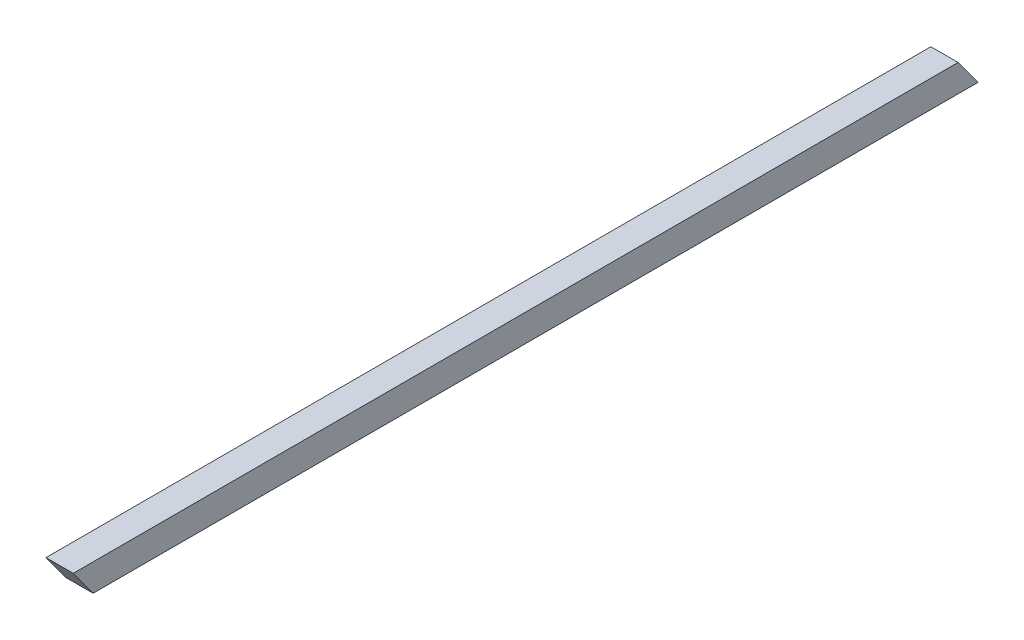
ISO-10303-21;
HEADER;
FILE_DESCRIPTION(('STEP AP214'),'2;1');
FILE_NAME('part.step','',(''),(''),'','','');
FILE_SCHEMA(('AUTOMOTIVE_DESIGN { 1 0 10303 214 1 1 1 1 }'));
ENDSEC;
DATA;
#1=APPLICATION_CONTEXT('core data for automotive mechanical design processes');
#2=APPLICATION_PROTOCOL_DEFINITION('international standard','automotive_design',2000,#1);
#3=PRODUCT_CONTEXT('',#1,'mechanical');
#4=PRODUCT('Part','Part','',(#3));
#5=PRODUCT_RELATED_PRODUCT_CATEGORY('part','',(#4));
#6=PRODUCT_DEFINITION_FORMATION('','',#4);
#7=PRODUCT_DEFINITION_CONTEXT('part definition',#1,'design');
#8=PRODUCT_DEFINITION('design','',#6,#7);
#9=PRODUCT_DEFINITION_SHAPE('','',#8);
#10=(LENGTH_UNIT() NAMED_UNIT(*) SI_UNIT(.MILLI.,.METRE.));
#11=(NAMED_UNIT(*) PLANE_ANGLE_UNIT() SI_UNIT($,.RADIAN.));
#12=(NAMED_UNIT(*) SI_UNIT($,.STERADIAN.) SOLID_ANGLE_UNIT());
#13=UNCERTAINTY_MEASURE_WITH_UNIT(LENGTH_MEASURE(1.E-05),#10,'distance_accuracy_value','');
#14=(GEOMETRIC_REPRESENTATION_CONTEXT(3) GLOBAL_UNCERTAINTY_ASSIGNED_CONTEXT((#13)) GLOBAL_UNIT_ASSIGNED_CONTEXT((#10,
#11,#12)) REPRESENTATION_CONTEXT('',''));
#15=CARTESIAN_POINT('',(0.,0.,0.));
#16=DIRECTION('',(0.,0.,1.));
#17=DIRECTION('',(1.,0.,0.));
#18=AXIS2_PLACEMENT_3D('',#15,#16,#17);
#19=CARTESIAN_POINT('',(-2.,2.,65.));
#20=DIRECTION('',(1.,0.,0.));
#21=DIRECTION('',(0.,0.,-1.));
#22=AXIS2_PLACEMENT_3D('',#19,#20,#21);
#23=PLANE('',#22);
#24=DIRECTION('',(0.,0.,-1.));
#25=VECTOR('',#24,1.);
#26=CARTESIAN_POINT('',(-2.,2.,65.));
#27=LINE('',#26,#25);
#28=CARTESIAN_POINT('',(-2.,2.,67.9234718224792));
#29=VERTEX_POINT('',#28);
#30=CARTESIAN_POINT('',(-2.,2.,-62.0765281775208));
#31=VERTEX_POINT('',#30);
#32=EDGE_CURVE('E66',#29,#31,#27,.T.);
#33=ORIENTED_EDGE('',*,*,#32,.T.);
#34=DIRECTION('',(0.,0.807353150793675,0.590068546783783));
#35=VECTOR('',#34,1.);
#36=CARTESIAN_POINT('',(-2.,-2.,-65.));
#37=LINE('',#36,#35);
#38=CARTESIAN_POINT('',(-2.,-2.,-65.));
#39=VERTEX_POINT('',#38);
#40=EDGE_CURVE('E84',#39,#31,#37,.T.);
#41=ORIENTED_EDGE('',*,*,#40,.F.);
#42=DIRECTION('',(0.,0.,-1.));
#43=VECTOR('',#42,1.);
#44=CARTESIAN_POINT('',(-2.,-2.,65.));
#45=LINE('',#44,#43);
#46=CARTESIAN_POINT('',(-2.,-2.,65.));
#47=VERTEX_POINT('',#46);
#48=EDGE_CURVE('E11',#47,#39,#45,.T.);
#49=ORIENTED_EDGE('',*,*,#48,.F.);
#50=DIRECTION('',(0.,0.807353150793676,0.590068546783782));
#51=VECTOR('',#50,1.);
#52=CARTESIAN_POINT('',(-2.,2.,67.9234718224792));
#53=LINE('',#52,#51);
#54=EDGE_CURVE('E81',#47,#29,#53,.T.);
#55=ORIENTED_EDGE('',*,*,#54,.T.);
#56=EDGE_LOOP('',(#33,#41,#49,#55));
#57=FACE_BOUND('',#56,.T.);
#58=ADVANCED_FACE('F27',(#57),#23,.F.);
#59=CARTESIAN_POINT('',(-2.,-2.,65.));
#60=DIRECTION('',(0.,1.,0.));
#61=DIRECTION('',(0.,0.,1.));
#62=AXIS2_PLACEMENT_3D('',#59,#60,#61);
#63=PLANE('',#62);
#64=DIRECTION('',(1.,0.,0.));
#65=VECTOR('',#64,1.);
#66=CARTESIAN_POINT('',(-2.,-2.,-65.));
#67=LINE('',#66,#65);
#68=CARTESIAN_POINT('',(2.,-2.,-65.));
#69=VERTEX_POINT('',#68);
#70=EDGE_CURVE('E94',#39,#69,#67,.T.);
#71=ORIENTED_EDGE('',*,*,#70,.T.);
#72=DIRECTION('',(0.,0.,-1.));
#73=VECTOR('',#72,1.);
#74=CARTESIAN_POINT('',(2.,-2.,65.));
#75=LINE('',#74,#73);
#76=CARTESIAN_POINT('',(2.,-2.,65.));
#77=VERTEX_POINT('',#76);
#78=EDGE_CURVE('E34',#77,#69,#75,.T.);
#79=ORIENTED_EDGE('',*,*,#78,.F.);
#80=DIRECTION('',(1.,0.,0.));
#81=VECTOR('',#80,1.);
#82=CARTESIAN_POINT('',(-2.,-2.,65.));
#83=LINE('',#82,#81);
#84=EDGE_CURVE('E43',#47,#77,#83,.T.);
#85=ORIENTED_EDGE('',*,*,#84,.F.);
#86=ORIENTED_EDGE('',*,*,#48,.T.);
#87=EDGE_LOOP('',(#71,#79,#85,#86));
#88=FACE_BOUND('',#87,.T.);
#89=ADVANCED_FACE('F101',(#88),#63,.F.);
#90=CARTESIAN_POINT('',(2.,2.,65.));
#91=DIRECTION('',(-1.,0.,0.));
#92=DIRECTION('',(0.,-1.,0.));
#93=AXIS2_PLACEMENT_3D('',#90,#91,#92);
#94=PLANE('',#93);
#95=ORIENTED_EDGE('',*,*,#78,.T.);
#96=DIRECTION('',(0.,0.807353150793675,0.590068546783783));
#97=VECTOR('',#96,1.);
#98=CARTESIAN_POINT('',(1.99999999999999,62.5384574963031,-17.8309095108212));
#99=LINE('',#98,#97);
#100=CARTESIAN_POINT('',(2.,2.,-62.0765281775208));
#101=VERTEX_POINT('',#100);
#102=EDGE_CURVE('E91',#69,#101,#99,.T.);
#103=ORIENTED_EDGE('',*,*,#102,.T.);
#104=DIRECTION('',(0.,0.,-1.));
#105=VECTOR('',#104,1.);
#106=CARTESIAN_POINT('',(2.,2.,65.));
#107=LINE('',#106,#105);
#108=CARTESIAN_POINT('',(2.,2.,67.9234718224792));
#109=VERTEX_POINT('',#108);
#110=EDGE_CURVE('E76',#109,#101,#107,.T.);
#111=ORIENTED_EDGE('',*,*,#110,.F.);
#112=DIRECTION('',(0.,0.807353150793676,0.590068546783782));
#113=VECTOR('',#112,1.);
#114=CARTESIAN_POINT('',(2.,2.,67.9234718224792));
#115=LINE('',#114,#113);
#116=EDGE_CURVE('E83',#77,#109,#115,.T.);
#117=ORIENTED_EDGE('',*,*,#116,.F.);
#118=EDGE_LOOP('',(#95,#103,#111,#117));
#119=FACE_BOUND('',#118,.T.);
#120=ADVANCED_FACE('F98',(#119),#94,.F.);
#121=CARTESIAN_POINT('',(-2.,2.,65.));
#122=DIRECTION('',(0.,-1.,0.));
#123=DIRECTION('',(1.,0.,0.));
#124=AXIS2_PLACEMENT_3D('',#121,#122,#123);
#125=PLANE('',#124);
#126=ORIENTED_EDGE('',*,*,#110,.T.);
#127=DIRECTION('',(-1.,0.,0.));
#128=VECTOR('',#127,1.);
#129=CARTESIAN_POINT('',(298.,2.,-62.0765281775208));
#130=LINE('',#129,#128);
#131=EDGE_CURVE('E72',#101,#31,#130,.T.);
#132=ORIENTED_EDGE('',*,*,#131,.T.);
#133=ORIENTED_EDGE('',*,*,#32,.F.);
#134=DIRECTION('',(-1.,0.,0.));
#135=VECTOR('',#134,1.);
#136=CARTESIAN_POINT('',(2.,2.,67.9234718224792));
#137=LINE('',#136,#135);
#138=EDGE_CURVE('E70',#109,#29,#137,.T.);
#139=ORIENTED_EDGE('',*,*,#138,.F.);
#140=EDGE_LOOP('',(#126,#132,#133,#139));
#141=FACE_BOUND('',#140,.T.);
#142=ADVANCED_FACE('F69',(#141),#125,.F.);
#143=CARTESIAN_POINT('',(298.,-2.,-65.));
#144=DIRECTION('',(0.,-0.590068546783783,0.807353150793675));
#145=DIRECTION('',(0.,-0.807353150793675,-0.590068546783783));
#146=AXIS2_PLACEMENT_3D('',#143,#144,#145);
#147=PLANE('',#146);
#148=ORIENTED_EDGE('',*,*,#70,.F.);
#149=ORIENTED_EDGE('',*,*,#40,.T.);
#150=ORIENTED_EDGE('',*,*,#131,.F.);
#151=ORIENTED_EDGE('',*,*,#102,.F.);
#152=EDGE_LOOP('',(#148,#149,#150,#151));
#153=FACE_BOUND('',#152,.T.);
#154=ADVANCED_FACE('F100',(#153),#147,.F.);
#155=CARTESIAN_POINT('',(2.,2.,67.9234718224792));
#156=DIRECTION('',(0.,-0.590068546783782,0.807353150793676));
#157=DIRECTION('',(0.,-0.807353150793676,-0.590068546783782));
#158=AXIS2_PLACEMENT_3D('',#155,#156,#157);
#159=PLANE('',#158);
#160=ORIENTED_EDGE('',*,*,#54,.F.);
#161=ORIENTED_EDGE('',*,*,#84,.T.);
#162=ORIENTED_EDGE('',*,*,#116,.T.);
#163=ORIENTED_EDGE('',*,*,#138,.T.);
#164=EDGE_LOOP('',(#160,#161,#162,#163));
#165=FACE_BOUND('',#164,.T.);
#166=ADVANCED_FACE('F80',(#165),#159,.T.);
#167=CLOSED_SHELL('',(#58,#89,#120,#142,#154,#166));
#168=MANIFOLD_SOLID_BREP('B2',#167);
#169=ADVANCED_BREP_SHAPE_REPRESENTATION('',(#18,#168),#14);
#170=SHAPE_DEFINITION_REPRESENTATION(#9,#169);
ENDSEC;
END-ISO-10303-21;
